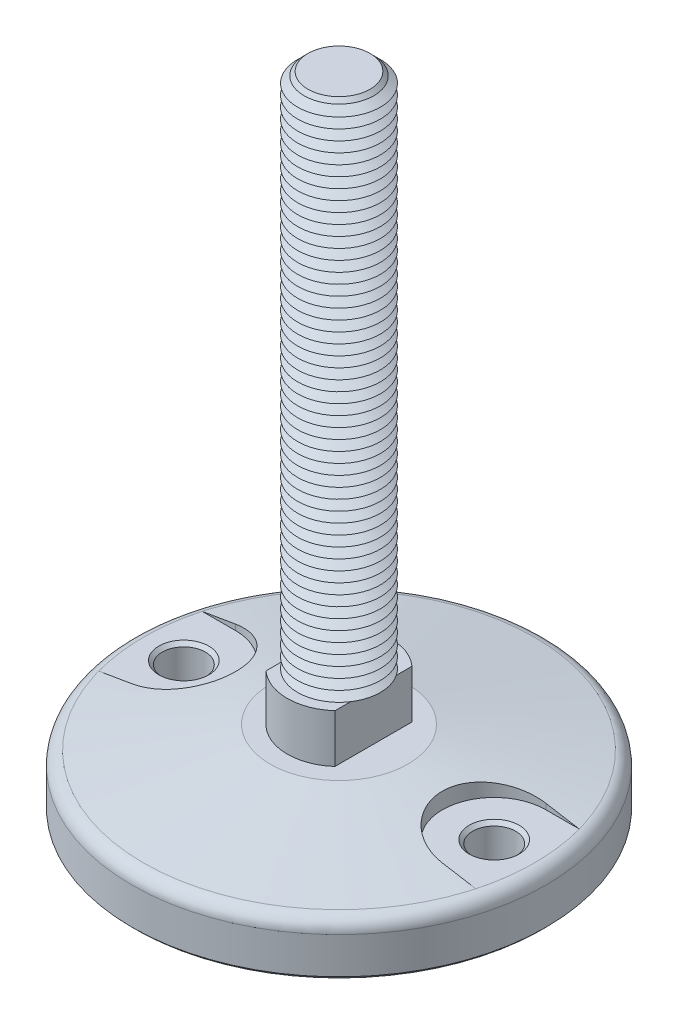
from build123d import *

# Parameters (mm, degrees)
FILLET1_R                = 4
SKETCH3_R                = 15
BOSS_EXTRUDE1_DEPTH      = 14
CUT_EXTRUDE1_START       = -14
CUT_EXTRUDE1_DEPTH       = 14
SKETCH5_R                = 12
BOSS_EXTRUDE2_DEPTH      = 150
CHAMFER1_SIZE            = 3
LPATTERN1_COUNT          = 50
LPATTERN1_PITCH          = 3
CUT_EXTRUDE4_DEPTH       = 6.47
SKETCH10_R               = 6.25
CUT_EXTRUDE5_DEPTH       = 15.53
CHAMFER2_SIZE            = 1
CHAMFER2_OF_MIRROR1_SIZE = 1
CHAMFER3_SIZE            = 1


with BuildPart() as part:
    # Sketch2 → Revolve1 (revolve)
    with BuildSketch(Plane(origin=(0, 0, 0), x_dir=(0, 0, -1), z_dir=(1, 0, 0)), mode=Mode.PRIVATE) as revolve1_sk:
        Polygon((0, 0), (-20, 0), (-60, -7.053079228), (-60, -22), (0, -22), align=None)
    revolve(revolve1_sk.sketch.rotate(Axis((0, 61.338865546, 0), (0, -1, 0)), 180), axis=Axis((0, 61.338865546, 0), (0, -1, 0)))

    # Fillet1
    fillet1_edges = [part.edges().sort_by_distance(p)[0] for p in [
        (0, -7.053079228, 60),
    ]]
    fillet(fillet1_edges, radius=FILLET1_R)

    # Sketch3 → Boss-Extrude1 (add)
    with BuildSketch(Plane(origin=(0, 0, 0), x_dir=(1, 0, 0), z_dir=(0, 1, 0))):
        with Locations(Location((0, 0, 0), (0, 0, 270))):
            Circle(SKETCH3_R)
    extrude(amount=BOSS_EXTRUDE1_DEPTH)

    # Sketch4 → Cut-Extrude1 (cut)
    with BuildSketch(Plane(origin=(0, 14, 0), x_dir=(1, 0, 0), z_dir=(0, 1, 0)).offset(CUT_EXTRUDE1_START)):
        with BuildLine():
            Line((-10, 11.180339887), (-10, -11.180339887))
            ThreePointArc((-10, -11.180339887), (-15, 0), (-10, 11.180339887))
        make_face()
        with BuildLine():
            Line((10, -11.180339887), (10, 11.180339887))
            ThreePointArc((10, 11.180339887), (15, 0), (10, -11.180339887))
        make_face()
    extrude(amount=CUT_EXTRUDE1_DEPTH, mode=Mode.SUBTRACT)

    # Sketch5 → Boss-Extrude2 (add)
    with BuildSketch(Plane(origin=(0, 14, 0), x_dir=(1, 0, 0), z_dir=(0, 1, 0))):
        with Locations(Location((0, 0, 0), (0, 0, 33.557309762))):
            Circle(SKETCH5_R)
    extrude(amount=BOSS_EXTRUDE2_DEPTH)

    # Chamfer1
    chamfer1_edges = [part.edges().sort_by_distance(p)[0] for p in [
        (-10, 164, 6.633249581),
    ]]
    chamfer(chamfer1_edges, length=CHAMFER1_SIZE)

    # Sketch6 → Cut-Revolve1 (revolve, cut)
    with BuildSketch(Plane(origin=(0, 0, 0), x_dir=(0, 0, -1), z_dir=(1, 0, 0))):
        Polygon((-12, 14), (-9.401923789, 15.5), (-12, 17), align=None)
    cut_revolve1 = revolve(axis=Axis((0, 61.338865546, 0), (0, -1, 0)), mode=Mode.SUBTRACT)

    # LPattern1: Cut-Revolve1 ×50
    with Locations(*[(0, i * LPATTERN1_PITCH, 0) for i in range(1, LPATTERN1_COUNT)]):
        add(cut_revolve1, mode=Mode.SUBTRACT)

    # Sketch8 → Cut-Extrude4 (cut)
    with BuildSketch(Plane(origin=(0, 0, 0), x_dir=(1, 0, 0), z_dir=(0, 1, 0))):
        with BuildLine():
            Line((-45, 15), (-54.674279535, 15))
            ThreePointArc((-54.674279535, 15), (-56.694592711, 0), (-54.674279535, -15))
            Line((-54.674279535, -15), (-45, -15))
            ThreePointArc((-45, -15), (-30, 0), (-45, 15))
        make_face()
    cut_extrude4 = extrude(amount=-CUT_EXTRUDE4_DEPTH, mode=Mode.SUBTRACT)

    # Sketch10 → Cut-Extrude5 (cut)
    with BuildSketch(Plane(origin=(0, -6.47, 0), x_dir=(1, 0, 0), z_dir=(0, 1, 0))):
        with Locations(Location((-45, 0, 0), (0, 0, 270))):
            Circle(SKETCH10_R)
    cut_extrude5 = extrude(amount=-CUT_EXTRUDE5_DEPTH, mode=Mode.SUBTRACT)

    # Chamfer2
    chamfer2_edges = [part.edges().sort_by_distance(p)[0] for p in [
        (-45, -6.47, -6.25),
        (-45, -22, -6.25),
    ]]
    chamfer(chamfer2_edges, length=CHAMFER2_SIZE)

    # Mirror1: Cut-Extrude4, Cut-Extrude5 across plane
    add(cut_extrude4.mirror(Plane(origin=(0, 0, 0), x_dir=(0, 0, 1), z_dir=(1, 0, 0))), mode=Mode.SUBTRACT)
    add(cut_extrude5.mirror(Plane(origin=(0, 0, 0), x_dir=(0, 0, 1), z_dir=(1, 0, 0))), mode=Mode.SUBTRACT)

    # Chamfer2 of Mirror1
    chamfer2_of_mirror1_edges = [part.edges().sort_by_distance(p)[0] for p in [
        (45, -6.47, -6.25),
        (45, -22, -6.25),
    ]]
    chamfer(chamfer2_of_mirror1_edges, length=CHAMFER2_OF_MIRROR1_SIZE)

    # Chamfer3
    chamfer3_edges = [part.edges().sort_by_distance(p)[0] for p in [
        (0, -22, 60),
    ]]
    chamfer(chamfer3_edges, length=CHAMFER3_SIZE)


solid = part.part
